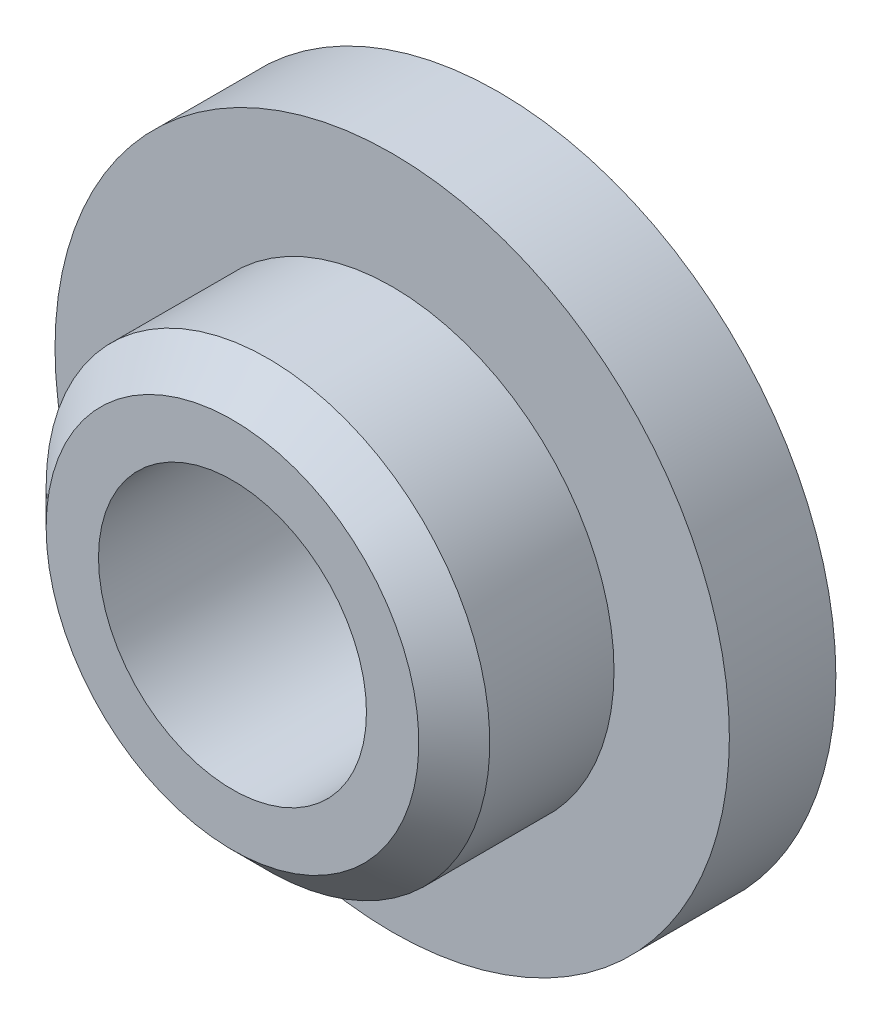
ISO-10303-21;
HEADER;
FILE_DESCRIPTION(('STEP AP214'),'2;1');
FILE_NAME('part.step','',(''),(''),'','','');
FILE_SCHEMA(('AUTOMOTIVE_DESIGN { 1 0 10303 214 1 1 1 1 }'));
ENDSEC;
DATA;
#1=APPLICATION_CONTEXT('core data for automotive mechanical design processes');
#2=APPLICATION_PROTOCOL_DEFINITION('international standard','automotive_design',2000,#1);
#3=PRODUCT_CONTEXT('',#1,'mechanical');
#4=PRODUCT('Part','Part','',(#3));
#5=PRODUCT_RELATED_PRODUCT_CATEGORY('part','',(#4));
#6=PRODUCT_DEFINITION_FORMATION('','',#4);
#7=PRODUCT_DEFINITION_CONTEXT('part definition',#1,'design');
#8=PRODUCT_DEFINITION('design','',#6,#7);
#9=PRODUCT_DEFINITION_SHAPE('','',#8);
#10=(LENGTH_UNIT() NAMED_UNIT(*) SI_UNIT(.MILLI.,.METRE.));
#11=(NAMED_UNIT(*) PLANE_ANGLE_UNIT() SI_UNIT($,.RADIAN.));
#12=(NAMED_UNIT(*) SI_UNIT($,.STERADIAN.) SOLID_ANGLE_UNIT());
#13=UNCERTAINTY_MEASURE_WITH_UNIT(LENGTH_MEASURE(1.E-05),#10,'distance_accuracy_value','');
#14=(GEOMETRIC_REPRESENTATION_CONTEXT(3) GLOBAL_UNCERTAINTY_ASSIGNED_CONTEXT((#13)) GLOBAL_UNIT_ASSIGNED_CONTEXT((#10,
#11,#12)) REPRESENTATION_CONTEXT('',''));
#15=CARTESIAN_POINT('',(0.,0.,0.));
#16=DIRECTION('',(0.,0.,1.));
#17=DIRECTION('',(1.,0.,0.));
#18=AXIS2_PLACEMENT_3D('',#15,#16,#17);
#19=CARTESIAN_POINT('',(0.,0.,6.));
#20=DIRECTION('',(0.,0.,-1.));
#21=DIRECTION('',(-1.,0.,0.));
#22=AXIS2_PLACEMENT_3D('',#19,#20,#21);
#23=CYLINDRICAL_SURFACE('',#22,19.);
#24=CARTESIAN_POINT('',(0.,0.,6.));
#25=DIRECTION('',(0.,0.,-1.));
#26=DIRECTION('',(1.,0.,0.));
#27=AXIS2_PLACEMENT_3D('',#24,#25,#26);
#28=CIRCLE('',#27,19.);
#29=CARTESIAN_POINT('',(19.,0.,6.));
#30=VERTEX_POINT('',#29);
#31=EDGE_CURVE('E25',#30,#30,#28,.T.);
#32=ORIENTED_EDGE('',*,*,#31,.T.);
#33=EDGE_LOOP('',(#32));
#34=FACE_BOUND('',#33,.T.);
#35=CARTESIAN_POINT('',(0.,0.,0.));
#36=DIRECTION('',(0.,0.,-1.));
#37=DIRECTION('',(1.,0.,0.));
#38=AXIS2_PLACEMENT_3D('',#35,#36,#37);
#39=CIRCLE('',#38,19.);
#40=CARTESIAN_POINT('',(19.,0.,0.));
#41=VERTEX_POINT('',#40);
#42=EDGE_CURVE('E29',#41,#41,#39,.T.);
#43=ORIENTED_EDGE('',*,*,#42,.F.);
#44=EDGE_LOOP('',(#43));
#45=FACE_BOUND('',#44,.T.);
#46=ADVANCED_FACE('F14',(#34,#45),#23,.T.);
#47=CARTESIAN_POINT('',(0.,0.,6.));
#48=DIRECTION('',(0.,0.,-1.));
#49=DIRECTION('',(-1.,0.,0.));
#50=AXIS2_PLACEMENT_3D('',#47,#48,#49);
#51=PLANE('',#50);
#52=CARTESIAN_POINT('',(0.,0.,6.));
#53=DIRECTION('',(0.,0.,-1.));
#54=DIRECTION('',(1.,0.,0.));
#55=AXIS2_PLACEMENT_3D('',#52,#53,#54);
#56=CIRCLE('',#55,12.5);
#57=CARTESIAN_POINT('',(12.5,0.,6.));
#58=VERTEX_POINT('',#57);
#59=EDGE_CURVE('E34',#58,#58,#56,.T.);
#60=ORIENTED_EDGE('',*,*,#59,.T.);
#61=EDGE_LOOP('',(#60));
#62=FACE_BOUND('',#61,.T.);
#63=ORIENTED_EDGE('',*,*,#31,.F.);
#64=EDGE_LOOP('',(#63));
#65=FACE_BOUND('',#64,.T.);
#66=ADVANCED_FACE('F66',(#62,#65),#51,.F.);
#67=CARTESIAN_POINT('',(0.,0.,0.));
#68=DIRECTION('',(0.,0.,-1.));
#69=DIRECTION('',(-1.,0.,0.));
#70=AXIS2_PLACEMENT_3D('',#67,#68,#69);
#71=PLANE('',#70);
#72=CARTESIAN_POINT('',(0.,0.,0.));
#73=DIRECTION('',(0.,0.,-1.));
#74=DIRECTION('',(-1.,0.,0.));
#75=AXIS2_PLACEMENT_3D('',#72,#73,#74);
#76=CIRCLE('',#75,7.55);
#77=CARTESIAN_POINT('',(-7.55,0.,0.));
#78=VERTEX_POINT('',#77);
#79=EDGE_CURVE('E39',#78,#78,#76,.T.);
#80=ORIENTED_EDGE('',*,*,#79,.F.);
#81=EDGE_LOOP('',(#80));
#82=FACE_BOUND('',#81,.T.);
#83=ORIENTED_EDGE('',*,*,#42,.T.);
#84=EDGE_LOOP('',(#83));
#85=FACE_BOUND('',#84,.T.);
#86=ADVANCED_FACE('F62',(#82,#85),#71,.T.);
#87=CARTESIAN_POINT('',(0.,0.,15.));
#88=DIRECTION('',(0.,0.,-1.));
#89=DIRECTION('',(-1.,0.,0.));
#90=AXIS2_PLACEMENT_3D('',#87,#88,#89);
#91=CYLINDRICAL_SURFACE('',#90,12.5);
#92=CARTESIAN_POINT('',(0.,0.,13.));
#93=DIRECTION('',(0.,0.,-1.));
#94=DIRECTION('',(-1.,0.,0.));
#95=AXIS2_PLACEMENT_3D('',#92,#93,#94);
#96=CIRCLE('',#95,12.5);
#97=CARTESIAN_POINT('',(-12.5,0.,13.));
#98=VERTEX_POINT('',#97);
#99=EDGE_CURVE('E21',#98,#98,#96,.T.);
#100=ORIENTED_EDGE('',*,*,#99,.T.);
#101=EDGE_LOOP('',(#100));
#102=FACE_BOUND('',#101,.T.);
#103=ORIENTED_EDGE('',*,*,#59,.F.);
#104=EDGE_LOOP('',(#103));
#105=FACE_BOUND('',#104,.T.);
#106=ADVANCED_FACE('F54',(#102,#105),#91,.T.);
#107=CARTESIAN_POINT('',(0.,0.,15.));
#108=DIRECTION('',(0.,0.,-1.));
#109=DIRECTION('',(-1.,0.,0.));
#110=AXIS2_PLACEMENT_3D('',#107,#108,#109);
#111=PLANE('',#110);
#112=CARTESIAN_POINT('',(0.,0.,15.));
#113=DIRECTION('',(0.,0.,1.));
#114=DIRECTION('',(1.,0.,0.));
#115=AXIS2_PLACEMENT_3D('',#112,#113,#114);
#116=CIRCLE('',#115,7.55);
#117=CARTESIAN_POINT('',(7.55,0.,15.));
#118=VERTEX_POINT('',#117);
#119=EDGE_CURVE('E42',#118,#118,#116,.T.);
#120=ORIENTED_EDGE('',*,*,#119,.F.);
#121=EDGE_LOOP('',(#120));
#122=FACE_BOUND('',#121,.T.);
#123=CARTESIAN_POINT('',(0.,0.,15.));
#124=DIRECTION('',(0.,0.,-1.));
#125=DIRECTION('',(-1.,0.,0.));
#126=AXIS2_PLACEMENT_3D('',#123,#124,#125);
#127=CIRCLE('',#126,10.5);
#128=CARTESIAN_POINT('',(-10.5,0.,15.));
#129=VERTEX_POINT('',#128);
#130=EDGE_CURVE('E9',#129,#129,#127,.F.);
#131=ORIENTED_EDGE('',*,*,#130,.T.);
#132=EDGE_LOOP('',(#131));
#133=FACE_BOUND('',#132,.T.);
#134=ADVANCED_FACE('F52',(#122,#133),#111,.F.);
#135=CARTESIAN_POINT('',(0.,0.,13.));
#136=DIRECTION('',(0.,0.,-1.));
#137=DIRECTION('',(-1.,0.,0.));
#138=AXIS2_PLACEMENT_3D('',#135,#136,#137);
#139=CONICAL_SURFACE('',#138,12.5,0.785398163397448);
#140=ORIENTED_EDGE('',*,*,#130,.F.);
#141=EDGE_LOOP('',(#140));
#142=FACE_BOUND('',#141,.T.);
#143=ORIENTED_EDGE('',*,*,#99,.F.);
#144=EDGE_LOOP('',(#143));
#145=FACE_BOUND('',#144,.T.);
#146=ADVANCED_FACE('F16',(#142,#145),#139,.T.);
#147=CARTESIAN_POINT('',(0.,0.,-40.7942649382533));
#148=DIRECTION('',(0.,0.,1.));
#149=DIRECTION('',(1.,0.,0.));
#150=AXIS2_PLACEMENT_3D('',#147,#148,#149);
#151=CYLINDRICAL_SURFACE('',#150,7.55);
#152=ORIENTED_EDGE('',*,*,#119,.T.);
#153=EDGE_LOOP('',(#152));
#154=FACE_BOUND('',#153,.T.);
#155=ORIENTED_EDGE('',*,*,#79,.T.);
#156=EDGE_LOOP('',(#155));
#157=FACE_BOUND('',#156,.T.);
#158=ADVANCED_FACE('F49',(#154,#157),#151,.F.);
#159=CLOSED_SHELL('',(#46,#66,#86,#106,#134,#146,#158));
#160=MANIFOLD_SOLID_BREP('B1',#159);
#161=ADVANCED_BREP_SHAPE_REPRESENTATION('',(#18,#160),#14);
#162=SHAPE_DEFINITION_REPRESENTATION(#9,#161);
ENDSEC;
END-ISO-10303-21;
